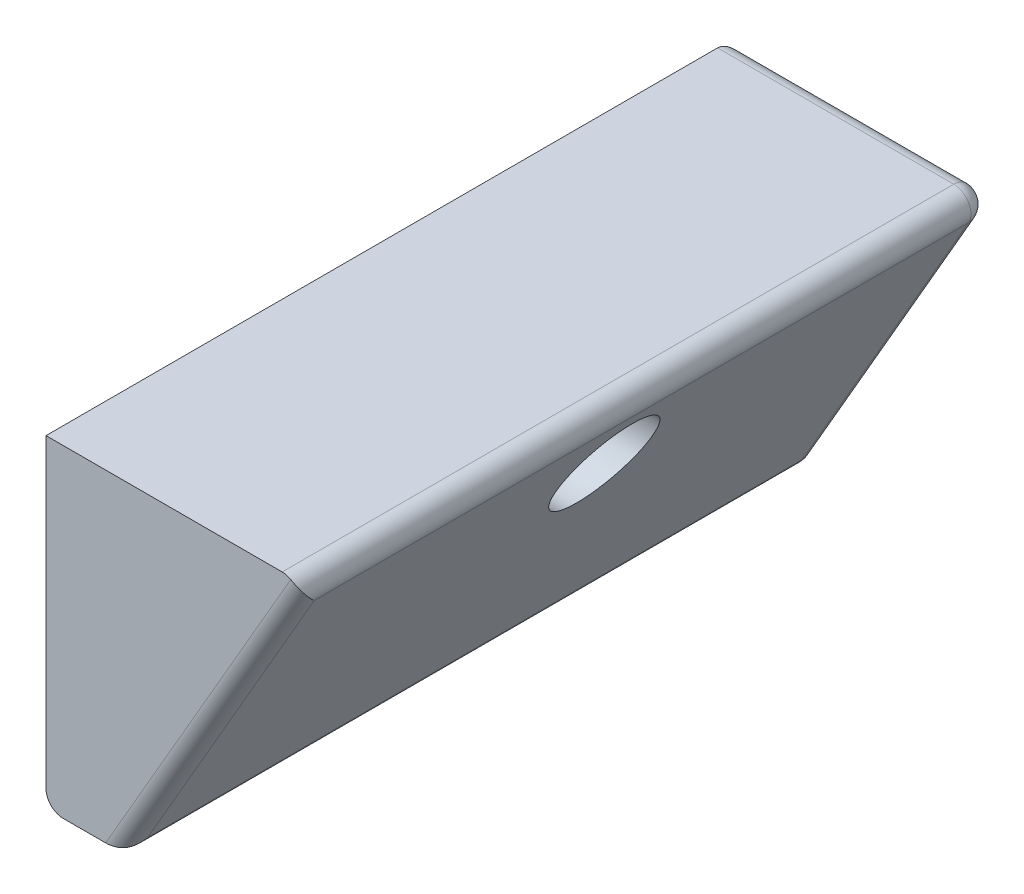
from build123d import *

# Parameters (mm, degrees)
EXTRUDE_1_DEPTH     = 20
SKETCH_3_R          = 1.65
CUT_EXTRUDE_2_DEPTH = 56
CUT_EXTRUDE_START   = 45
SKETCH_4_R          = 2.8
CUT_EXTRUDE_3_DEPTH = 56
FILLET_1_R          = 1


with BuildPart() as part:
    # Sketch 1 → Extrude 1 (new, symmetric)
    with BuildSketch(Plane.XY):
        Polygon((37.335050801, -277.980978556), (37.335050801, -259.227060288), (52.781432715, -259.227060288), (41.953852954, -277.980978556), align=None)
    extrude(amount=EXTRUDE_1_DEPTH, both=True)

    # Sketch 3 → Cut-Extrude 2 (cut)
    with BuildSketch(Plane(origin=(0, 0, 0), x_dir=(0, 0, -1), z_dir=(1, 0, 0))):
        with Locations(Location((0.070634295, -264.339999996, 0), (0, 0, 90))):
            Circle(SKETCH_3_R)
    extrude(amount=CUT_EXTRUDE_2_DEPTH, mode=Mode.SUBTRACT)

    # Sketch 4 → Cut-Extrude 3 (cut)
    with BuildSketch(Plane(origin=(0, 0, 0), x_dir=(0, 0, -1), z_dir=(1, 0, 0)).offset(CUT_EXTRUDE_START)):
        with Locations(Location((-0.070634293, -264.339999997, 0), (0, 0, 270))):
            Circle(SKETCH_4_R)
    extrude(amount=CUT_EXTRUDE_3_DEPTH, mode=Mode.SUBTRACT)

    # Fillet 1
    fillet_1_edges = [part.edges().sort_by_distance(p)[0] for p in [
        (47.367642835, -268.604019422, 20),
        (47.367642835, -268.604019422, -20),
        (39.644451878, -277.980978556, -20),
        (37.335050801, -268.604019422, -20),
        (45.058241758, -259.227060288, -20),
        (52.781432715, -259.227060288, 0),
        (41.953852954, -277.980978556, 0),
        (37.335050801, -277.980978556, 0),
    ]]
    fillet(fillet_1_edges, radius=FILLET_1_R)


solid = part.part
